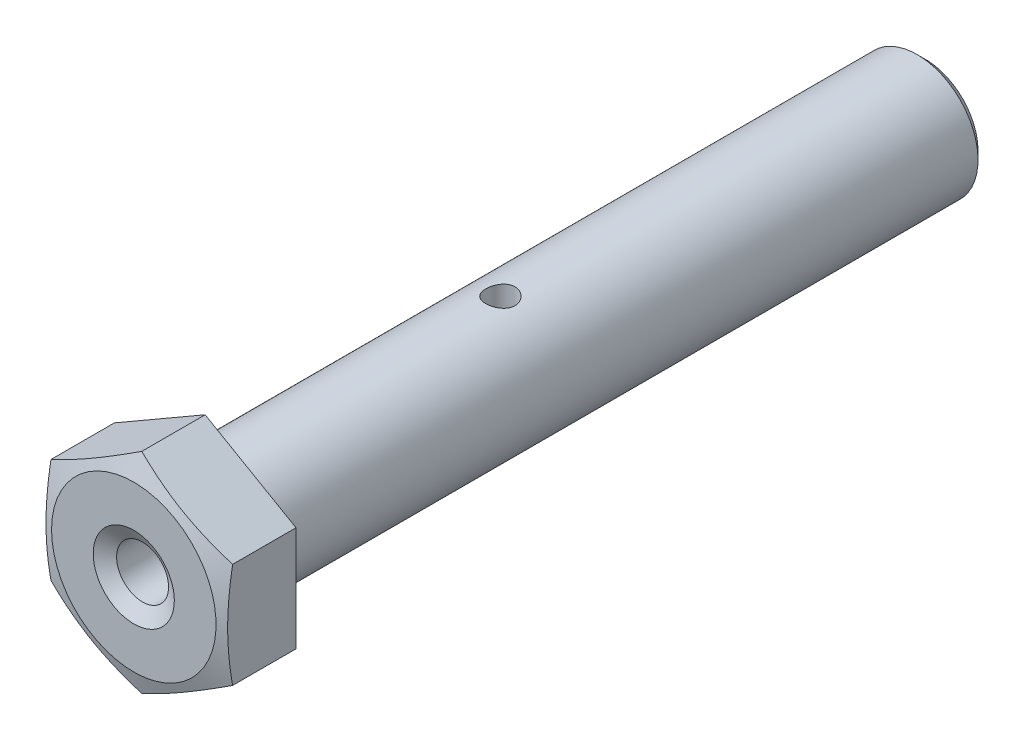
ISO-10303-21;
HEADER;
FILE_DESCRIPTION(('STEP AP214'),'2;1');
FILE_NAME('part.step','',(''),(''),'','','');
FILE_SCHEMA(('AUTOMOTIVE_DESIGN { 1 0 10303 214 1 1 1 1 }'));
ENDSEC;
DATA;
#1=APPLICATION_CONTEXT('core data for automotive mechanical design processes');
#2=APPLICATION_PROTOCOL_DEFINITION('international standard','automotive_design',2000,#1);
#3=PRODUCT_CONTEXT('',#1,'mechanical');
#4=PRODUCT('Part','Part','',(#3));
#5=PRODUCT_RELATED_PRODUCT_CATEGORY('part','',(#4));
#6=PRODUCT_DEFINITION_FORMATION('','',#4);
#7=PRODUCT_DEFINITION_CONTEXT('part definition',#1,'design');
#8=PRODUCT_DEFINITION('design','',#6,#7);
#9=PRODUCT_DEFINITION_SHAPE('','',#8);
#10=(LENGTH_UNIT() NAMED_UNIT(*) SI_UNIT(.MILLI.,.METRE.));
#11=(NAMED_UNIT(*) PLANE_ANGLE_UNIT() SI_UNIT($,.RADIAN.));
#12=(NAMED_UNIT(*) SI_UNIT($,.STERADIAN.) SOLID_ANGLE_UNIT());
#13=UNCERTAINTY_MEASURE_WITH_UNIT(LENGTH_MEASURE(1.E-05),#10,'distance_accuracy_value','');
#14=(GEOMETRIC_REPRESENTATION_CONTEXT(3) GLOBAL_UNCERTAINTY_ASSIGNED_CONTEXT((#13)) GLOBAL_UNIT_ASSIGNED_CONTEXT((#10,
#11,#12)) REPRESENTATION_CONTEXT('',''));
#15=CARTESIAN_POINT('',(0.,0.,0.));
#16=DIRECTION('',(0.,0.,1.));
#17=DIRECTION('',(1.,0.,0.));
#18=AXIS2_PLACEMENT_3D('',#15,#16,#17);
#19=CARTESIAN_POINT('',(0.,0.,4.95721434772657));
#20=DIRECTION('',(0.,0.,-1.));
#21=DIRECTION('',(-1.,0.,0.));
#22=AXIS2_PLACEMENT_3D('',#19,#20,#21);
#23=CONICAL_SURFACE('',#22,8.22286118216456,1.23066390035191);
#24=CARTESIAN_POINT('',(-7.11200000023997,4.1061151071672,4.960976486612));
#25=CARTESIAN_POINT('',(-6.81737936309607,4.27621441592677,5.02119241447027));
#26=CARTESIAN_POINT('',(-6.52183875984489,4.44684486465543,5.07595591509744));
#27=CARTESIAN_POINT('',(-5.92894062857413,4.78915476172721,5.17228765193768));
#28=CARTESIAN_POINT('',(-5.63158192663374,4.96083488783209,5.21384617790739));
#29=CARTESIAN_POINT('',(-5.03816993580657,5.30344146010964,5.28108026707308));
#30=CARTESIAN_POINT('',(-4.74212876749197,5.47436090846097,5.30689459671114));
#31=CARTESIAN_POINT('',(-4.14939155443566,5.81657789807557,5.3415176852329));
#32=CARTESIAN_POINT('',(-3.85269577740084,5.98787528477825,5.35033243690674));
#33=CARTESIAN_POINT('',(-3.25930422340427,6.3304700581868,5.35033243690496));
#34=CARTESIAN_POINT('',(-2.96260844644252,6.50176744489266,5.3415176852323));
#35=CARTESIAN_POINT('',(-2.36987123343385,6.84398443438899,5.30689459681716));
#36=CARTESIAN_POINT('',(-2.0738300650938,7.01490388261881,5.2810802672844));
#37=CARTESIAN_POINT('',(-1.48041807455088,7.35751045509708,5.21384617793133));
#38=CARTESIAN_POINT('',(-1.18305937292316,7.52919058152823,5.17228765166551));
#39=CARTESIAN_POINT('',(-0.590161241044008,7.87150047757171,5.075955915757));
#40=CARTESIAN_POINT('',(-0.294620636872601,8.04213092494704,5.02119241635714));
#41=CARTESIAN_POINT('',(2.60407290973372E-09,8.2122302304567,4.96097649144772));
#42=B_SPLINE_CURVE_WITH_KNOTS('',3,(#24,#25,#26,#27,#28,#29,#30,#31,#32,#33,#34,#35,#36,#37,#38,
#39,#40,#41),.UNSPECIFIED.,.F.,.F.,(4,2,2,2,2,2,2,2,4),(0.,1.03656037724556,2.07388123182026,
3.1019219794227,4.12960024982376,5.15727852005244,6.18531926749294,7.22264012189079,
8.25920049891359),.UNSPECIFIED.);
#43=CARTESIAN_POINT('',(-7.11200000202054,4.10611511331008,4.96097649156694));
#44=VERTEX_POINT('',#43);
#45=CARTESIAN_POINT('',(0.,8.21223023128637,4.96097649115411));
#46=VERTEX_POINT('',#45);
#47=EDGE_CURVE('E20',#44,#46,#42,.T.);
#48=ORIENTED_EDGE('',*,*,#47,.F.);
#49=CARTESIAN_POINT('',(-7.11199999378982,4.10611511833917,4.960976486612));
#50=CARTESIAN_POINT('',(-7.11199999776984,3.76591650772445,5.02119241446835));
#51=CARTESIAN_POINT('',(-7.11199999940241,3.42465561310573,5.07595591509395));
#52=CARTESIAN_POINT('',(-7.11200000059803,2.74003582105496,5.17228765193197));
#53=CARTESIAN_POINT('',(-7.11200000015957,2.39667556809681,5.21384617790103));
#54=CARTESIAN_POINT('',(-7.11199999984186,1.71146242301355,5.28108026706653));
#55=CARTESIAN_POINT('',(-7.11199999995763,1.36962352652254,5.30689459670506));
#56=CARTESIAN_POINT('',(-7.11200000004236,0.685189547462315,5.34151768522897));
#57=CARTESIAN_POINT('',(-7.11200000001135,0.342594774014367,5.3503324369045));
#58=CARTESIAN_POINT('',(-7.11199999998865,-0.342594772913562,5.35033243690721));
#59=CARTESIAN_POINT('',(-7.11199999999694,-0.685189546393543,5.34151768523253));
#60=CARTESIAN_POINT('',(-7.11200000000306,-1.36962352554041,5.30689459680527));
#61=CARTESIAN_POINT('',(-7.11200000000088,-1.71146242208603,5.28108026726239));
#62=CARTESIAN_POINT('',(-7.11199999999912,-2.39667556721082,5.21384617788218));
#63=CARTESIAN_POINT('',(-7.11199999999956,-2.74003582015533,5.17228765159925));
#64=CARTESIAN_POINT('',(-7.11200000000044,-3.42465561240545,5.07595591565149));
#65=CARTESIAN_POINT('',(-7.11200000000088,-3.76591650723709,5.0211924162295));
#66=CARTESIAN_POINT('',(-7.112,-4.10611511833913,4.96097649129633));
#67=B_SPLINE_CURVE_WITH_KNOTS('',3,(#49,#50,#51,#52,#53,#54,#55,#56,#57,#58,#59,#60,#61,#62,#63,
#64,#65,#66),.UNSPECIFIED.,.F.,.F.,(4,2,2,2,2,2,2,2,4),(0.,1.03656037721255,2.07388123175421,
3.10192197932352,4.12960024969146,5.1572785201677,6.18531926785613,7.22264012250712,
8.25920049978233),.UNSPECIFIED.);
#68=CARTESIAN_POINT('',(-7.11200000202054,-4.10611511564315,4.96097649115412));
#69=VERTEX_POINT('',#68);
#70=EDGE_CURVE('E73',#44,#69,#67,.T.);
#71=ORIENTED_EDGE('',*,*,#70,.T.);
#72=CARTESIAN_POINT('',(6.45011977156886E-09,-8.21223022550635,4.960976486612));
#73=CARTESIAN_POINT('',(-0.294620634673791,-8.04213092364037,5.02119241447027));
#74=CARTESIAN_POINT('',(-0.590161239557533,-7.8715004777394,5.07595591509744));
#75=CARTESIAN_POINT('',(-1.18305937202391,-7.52919058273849,5.17228765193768));
#76=CARTESIAN_POINT('',(-1.48041807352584,-7.35751045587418,5.21384617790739));
#77=CARTESIAN_POINT('',(-2.07383006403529,-7.01490388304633,5.28108026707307));
#78=CARTESIAN_POINT('',(-2.36987123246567,-6.84398443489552,5.30689459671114));
#79=CARTESIAN_POINT('',(-2.9626084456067,-6.50176744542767,5.3415176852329));
#80=CARTESIAN_POINT('',(-3.25930422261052,-6.33047005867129,5.35033243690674));
#81=CARTESIAN_POINT('',(-3.85269577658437,-5.98787528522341,5.35033243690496));
#82=CARTESIAN_POINT('',(-4.14939155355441,-5.81657789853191,5.3415176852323));
#83=CARTESIAN_POINT('',(-4.74212876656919,-5.47436090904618,5.30689459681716));
#84=CARTESIAN_POINT('',(-5.03816993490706,-5.30344146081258,5.28108026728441));
#85=CARTESIAN_POINT('',(-5.63158192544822,-4.96083488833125,5.21384617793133));
#86=CARTESIAN_POINT('',(-5.92894062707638,-4.78915476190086,5.17228765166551));
#87=CARTESIAN_POINT('',(-6.52183875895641,-4.44684486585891,5.07595591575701));
#88=CARTESIAN_POINT('',(-6.81737936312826,-4.27621441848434,5.02119241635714));
#89=CARTESIAN_POINT('',(-7.11200000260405,-4.10611511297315,4.96097649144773));
#90=B_SPLINE_CURVE_WITH_KNOTS('',3,(#72,#73,#74,#75,#76,#77,#78,#79,#80,#81,#82,#83,#84,#85,#86,
#87,#88,#89),.UNSPECIFIED.,.F.,.F.,(4,2,2,2,2,2,2,2,4),(0.,1.03656037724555,2.07388123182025,
3.10192197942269,4.12960024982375,5.15727852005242,6.18531926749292,7.22264012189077,
8.25920049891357),.UNSPECIFIED.);
#91=CARTESIAN_POINT('',(0.,-8.21223023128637,4.96097649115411));
#92=VERTEX_POINT('',#91);
#93=EDGE_CURVE('E102',#92,#69,#90,.T.);
#94=ORIENTED_EDGE('',*,*,#93,.F.);
#95=CARTESIAN_POINT('',(7.11200000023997,-4.1061151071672,4.96097648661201));
#96=CARTESIAN_POINT('',(6.81737936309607,-4.27621441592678,5.02119241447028));
#97=CARTESIAN_POINT('',(6.52183875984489,-4.44684486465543,5.07595591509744));
#98=CARTESIAN_POINT('',(5.92894062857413,-4.78915476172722,5.17228765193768));
#99=CARTESIAN_POINT('',(5.63158192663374,-4.96083488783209,5.21384617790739));
#100=CARTESIAN_POINT('',(5.03816993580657,-5.30344146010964,5.28108026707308));
#101=CARTESIAN_POINT('',(4.74212876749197,-5.47436090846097,5.30689459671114));
#102=CARTESIAN_POINT('',(4.14939155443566,-5.81657789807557,5.3415176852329));
#103=CARTESIAN_POINT('',(3.85269577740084,-5.98787528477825,5.35033243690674));
#104=CARTESIAN_POINT('',(3.25930422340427,-6.3304700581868,5.35033243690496));
#105=CARTESIAN_POINT('',(2.96260844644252,-6.50176744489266,5.3415176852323));
#106=CARTESIAN_POINT('',(2.36987123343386,-6.84398443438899,5.30689459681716));
#107=CARTESIAN_POINT('',(2.0738300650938,-7.01490388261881,5.28108026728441));
#108=CARTESIAN_POINT('',(1.48041807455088,-7.35751045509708,5.21384617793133));
#109=CARTESIAN_POINT('',(1.18305937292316,-7.52919058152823,5.17228765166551));
#110=CARTESIAN_POINT('',(0.590161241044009,-7.8715004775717,5.075955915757));
#111=CARTESIAN_POINT('',(0.294620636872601,-8.04213092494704,5.02119241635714));
#112=CARTESIAN_POINT('',(-2.6040717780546E-09,-8.2122302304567,4.96097649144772));
#113=B_SPLINE_CURVE_WITH_KNOTS('',3,(#95,#96,#97,#98,#99,#100,#101,#102,#103,#104,#105,#106,
#107,#108,#109,#110,#111,#112),.UNSPECIFIED.,.F.,.F.,(4,2,2,2,2,2,2,2,4),(0.,1.03656037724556,
2.07388123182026,3.1019219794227,4.12960024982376,5.15727852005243,6.18531926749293,
7.22264012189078,8.25920049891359),.UNSPECIFIED.);
#114=CARTESIAN_POINT('',(7.11200000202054,-4.1061151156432,4.96097649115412));
#115=VERTEX_POINT('',#114);
#116=EDGE_CURVE('E126',#115,#92,#113,.T.);
#117=ORIENTED_EDGE('',*,*,#116,.F.);
#118=CARTESIAN_POINT('',(7.11199999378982,4.10611511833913,4.96097648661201));
#119=CARTESIAN_POINT('',(7.11199999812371,3.76591650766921,5.02119241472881));
#120=CARTESIAN_POINT('',(7.1119999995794,3.42465561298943,5.07595591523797));
#121=CARTESIAN_POINT('',(7.11200000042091,2.74003582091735,5.17228765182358));
#122=CARTESIAN_POINT('',(7.11199999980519,2.39667556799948,5.2138461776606));
#123=CARTESIAN_POINT('',(7.11200000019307,1.71146242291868,5.28108026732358));
#124=CARTESIAN_POINT('',(7.11200000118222,1.36962352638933,5.30689459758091));
#125=CARTESIAN_POINT('',(7.1119999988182,0.685189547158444,5.34151768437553));
#126=CARTESIAN_POINT('',(7.11199999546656,0.342594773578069,5.35033243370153));
#127=CARTESIAN_POINT('',(7.11199999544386,-0.342594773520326,5.35033243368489));
#128=CARTESIAN_POINT('',(7.11199999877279,-0.685189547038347,5.34151768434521));
#129=CARTESIAN_POINT('',(7.11200000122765,-1.36962352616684,5.30689459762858));
#130=CARTESIAN_POINT('',(7.11200000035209,-1.71146242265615,5.28108026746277));
#131=CARTESIAN_POINT('',(7.11199999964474,-2.39667556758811,5.21384617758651));
#132=CARTESIAN_POINT('',(7.11199999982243,-2.74003582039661,5.17228765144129));
#133=CARTESIAN_POINT('',(7.11200000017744,-3.42465561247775,5.07595591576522));
#134=CARTESIAN_POINT('',(7.11200000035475,-3.76591650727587,5.02119241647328));
#135=CARTESIAN_POINT('',(7.112,-4.10611511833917,4.96097649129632));
#136=B_SPLINE_CURVE_WITH_KNOTS('',3,(#118,#119,#120,#121,#122,#123,#124,#125,#126,#127,#128,
#129,#130,#131,#132,#133,#134,#135),.UNSPECIFIED.,.F.,.F.,(4,2,2,2,2,2,2,2,4),(0.,
1.03656037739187,2.07388123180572,3.10192197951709,4.12960025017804,5.15727852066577,
6.18531926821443,7.22264012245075,8.25920049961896),.UNSPECIFIED.);
#137=CARTESIAN_POINT('',(7.11200000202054,4.10611511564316,4.96097649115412));
#138=VERTEX_POINT('',#137);
#139=EDGE_CURVE('E133',#138,#115,#136,.T.);
#140=ORIENTED_EDGE('',*,*,#139,.F.);
#141=CARTESIAN_POINT('',(-6.45011611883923E-09,8.21223022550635,4.960976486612));
#142=CARTESIAN_POINT('',(0.294620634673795,8.04213092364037,5.02119241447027));
#143=CARTESIAN_POINT('',(0.590161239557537,7.8715004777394,5.07595591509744));
#144=CARTESIAN_POINT('',(1.18305937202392,7.52919058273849,5.17228765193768));
#145=CARTESIAN_POINT('',(1.48041807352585,7.35751045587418,5.21384617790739));
#146=CARTESIAN_POINT('',(2.0738300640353,7.01490388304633,5.28108026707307));
#147=CARTESIAN_POINT('',(2.36987123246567,6.84398443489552,5.30689459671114));
#148=CARTESIAN_POINT('',(2.96260844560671,6.50176744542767,5.3415176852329));
#149=CARTESIAN_POINT('',(3.25930422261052,6.33047005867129,5.35033243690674));
#150=CARTESIAN_POINT('',(3.85269577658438,5.98787528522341,5.35033243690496));
#151=CARTESIAN_POINT('',(4.14939155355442,5.81657789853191,5.3415176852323));
#152=CARTESIAN_POINT('',(4.7421287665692,5.47436090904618,5.30689459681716));
#153=CARTESIAN_POINT('',(5.03816993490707,5.30344146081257,5.28108026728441));
#154=CARTESIAN_POINT('',(5.63158192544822,4.96083488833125,5.21384617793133));
#155=CARTESIAN_POINT('',(5.92894062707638,4.78915476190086,5.17228765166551));
#156=CARTESIAN_POINT('',(6.52183875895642,4.44684486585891,5.075955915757));
#157=CARTESIAN_POINT('',(6.81737936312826,4.27621441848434,5.02119241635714));
#158=CARTESIAN_POINT('',(7.11200000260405,4.10611511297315,4.96097649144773));
#159=B_SPLINE_CURVE_WITH_KNOTS('',3,(#141,#142,#143,#144,#145,#146,#147,#148,#149,#150,#151,
#152,#153,#154,#155,#156,#157,#158),.UNSPECIFIED.,.F.,.F.,(4,2,2,2,2,2,2,2,4),(0.,
1.03656037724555,2.07388123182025,3.10192197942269,4.12960024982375,5.15727852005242,
6.18531926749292,7.22264012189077,8.25920049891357),.UNSPECIFIED.);
#160=EDGE_CURVE('E76',#46,#138,#159,.T.);
#161=ORIENTED_EDGE('',*,*,#160,.F.);
#162=EDGE_LOOP('',(#48,#71,#94,#117,#140,#161));
#163=FACE_BOUND('',#162,.T.);
#164=CARTESIAN_POINT('',(0.,0.,5.58800002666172));
#165=DIRECTION('',(0.,0.,-1.));
#166=DIRECTION('',(-1.,0.,0.));
#167=AXIS2_PLACEMENT_3D('',#164,#165,#166);
#168=CIRCLE('',#167,6.44040612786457);
#169=CARTESIAN_POINT('',(-6.44040612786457,0.,5.58800002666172));
#170=VERTEX_POINT('',#169);
#171=EDGE_CURVE('E92',#170,#170,#168,.T.);
#172=ORIENTED_EDGE('',*,*,#171,.T.);
#173=EDGE_LOOP('',(#172));
#174=FACE_BOUND('',#173,.T.);
#175=ADVANCED_FACE('F16',(#163,#174),#23,.T.);
#176=CARTESIAN_POINT('',(-7.112,4.10611511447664,5.588));
#177=DIRECTION('',(-0.499999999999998,0.86602540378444,0.));
#178=DIRECTION('',(-0.86602540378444,-0.499999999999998,0.));
#179=AXIS2_PLACEMENT_3D('',#176,#177,#178);
#180=PLANE('',#179);
#181=DIRECTION('',(0.,0.,1.));
#182=VECTOR('',#181,1.);
#183=CARTESIAN_POINT('',(0.,8.21223022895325,5.588));
#184=LINE('',#183,#182);
#185=CARTESIAN_POINT('',(0.,8.21223022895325,0.));
#186=VERTEX_POINT('',#185);
#187=EDGE_CURVE('E79',#186,#46,#184,.T.);
#188=ORIENTED_EDGE('',*,*,#187,.F.);
#189=DIRECTION('',(0.86602540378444,0.499999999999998,0.));
#190=VECTOR('',#189,1.);
#191=CARTESIAN_POINT('',(-7.112,4.10611511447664,0.));
#192=LINE('',#191,#190);
#193=CARTESIAN_POINT('',(-7.112,4.10611511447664,0.));
#194=VERTEX_POINT('',#193);
#195=EDGE_CURVE('E84',#194,#186,#192,.T.);
#196=ORIENTED_EDGE('',*,*,#195,.F.);
#197=DIRECTION('',(0.,0.,-1.));
#198=VECTOR('',#197,1.);
#199=CARTESIAN_POINT('',(-7.112,4.10611511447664,5.588));
#200=LINE('',#199,#198);
#201=EDGE_CURVE('E81',#194,#44,#200,.F.);
#202=ORIENTED_EDGE('',*,*,#201,.T.);
#203=ORIENTED_EDGE('',*,*,#47,.T.);
#204=EDGE_LOOP('',(#188,#196,#202,#203));
#205=FACE_BOUND('',#204,.T.);
#206=ADVANCED_FACE('F82',(#205),#180,.T.);
#207=CARTESIAN_POINT('',(0.,8.21223022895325,5.588));
#208=DIRECTION('',(0.500000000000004,0.866025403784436,0.));
#209=DIRECTION('',(-0.866025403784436,0.500000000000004,0.));
#210=AXIS2_PLACEMENT_3D('',#207,#208,#209);
#211=PLANE('',#210);
#212=DIRECTION('',(0.,0.,-1.));
#213=VECTOR('',#212,1.);
#214=CARTESIAN_POINT('',(7.112,4.10611511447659,5.588));
#215=LINE('',#214,#213);
#216=CARTESIAN_POINT('',(7.112,4.10611511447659,0.));
#217=VERTEX_POINT('',#216);
#218=EDGE_CURVE('E137',#217,#138,#215,.F.);
#219=ORIENTED_EDGE('',*,*,#218,.F.);
#220=DIRECTION('',(0.866025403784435,-0.500000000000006,0.));
#221=VECTOR('',#220,1.);
#222=CARTESIAN_POINT('',(0.,8.21223022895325,0.));
#223=LINE('',#222,#221);
#224=EDGE_CURVE('E237',#186,#217,#223,.T.);
#225=ORIENTED_EDGE('',*,*,#224,.F.);
#226=ORIENTED_EDGE('',*,*,#187,.T.);
#227=ORIENTED_EDGE('',*,*,#160,.T.);
#228=EDGE_LOOP('',(#219,#225,#226,#227));
#229=FACE_BOUND('',#228,.T.);
#230=ADVANCED_FACE('F141',(#229),#211,.T.);
#231=CARTESIAN_POINT('',(7.112,4.10611511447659,5.588));
#232=DIRECTION('',(1.,0.,0.));
#233=DIRECTION('',(0.,0.,-1.));
#234=AXIS2_PLACEMENT_3D('',#231,#232,#233);
#235=PLANE('',#234);
#236=DIRECTION('',(0.,0.,1.));
#237=VECTOR('',#236,1.);
#238=CARTESIAN_POINT('',(7.112,-4.10611511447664,5.588));
#239=LINE('',#238,#237);
#240=CARTESIAN_POINT('',(7.112,-4.10611511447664,0.));
#241=VERTEX_POINT('',#240);
#242=EDGE_CURVE('E132',#241,#115,#239,.T.);
#243=ORIENTED_EDGE('',*,*,#242,.F.);
#244=DIRECTION('',(0.,1.,0.));
#245=VECTOR('',#244,1.);
#246=CARTESIAN_POINT('',(7.112,12.3183453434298,0.));
#247=LINE('',#246,#245);
#248=EDGE_CURVE('E227',#217,#241,#247,.F.);
#249=ORIENTED_EDGE('',*,*,#248,.F.);
#250=ORIENTED_EDGE('',*,*,#218,.T.);
#251=ORIENTED_EDGE('',*,*,#139,.T.);
#252=EDGE_LOOP('',(#243,#249,#250,#251));
#253=FACE_BOUND('',#252,.T.);
#254=ADVANCED_FACE('F122',(#253),#235,.T.);
#255=CARTESIAN_POINT('',(7.112,-4.10611511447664,5.588));
#256=DIRECTION('',(0.499999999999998,-0.86602540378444,0.));
#257=DIRECTION('',(0.86602540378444,0.499999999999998,0.));
#258=AXIS2_PLACEMENT_3D('',#255,#256,#257);
#259=PLANE('',#258);
#260=DIRECTION('',(0.,0.,1.));
#261=VECTOR('',#260,1.);
#262=CARTESIAN_POINT('',(0.,-8.21223022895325,5.588));
#263=LINE('',#262,#261);
#264=CARTESIAN_POINT('',(0.,-8.21223022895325,0.));
#265=VERTEX_POINT('',#264);
#266=EDGE_CURVE('E131',#265,#92,#263,.T.);
#267=ORIENTED_EDGE('',*,*,#266,.F.);
#268=DIRECTION('',(-0.86602540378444,-0.499999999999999,0.));
#269=VECTOR('',#268,1.);
#270=CARTESIAN_POINT('',(7.112,-4.10611511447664,0.));
#271=LINE('',#270,#269);
#272=EDGE_CURVE('E222',#241,#265,#271,.T.);
#273=ORIENTED_EDGE('',*,*,#272,.F.);
#274=ORIENTED_EDGE('',*,*,#242,.T.);
#275=ORIENTED_EDGE('',*,*,#116,.T.);
#276=EDGE_LOOP('',(#267,#273,#274,#275));
#277=FACE_BOUND('',#276,.T.);
#278=ADVANCED_FACE('F117',(#277),#259,.T.);
#279=CARTESIAN_POINT('',(0.,-8.21223022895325,5.588));
#280=DIRECTION('',(-0.500000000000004,-0.866025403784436,0.));
#281=DIRECTION('',(0.866025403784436,-0.500000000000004,0.));
#282=AXIS2_PLACEMENT_3D('',#279,#280,#281);
#283=PLANE('',#282);
#284=DIRECTION('',(0.,0.,-1.));
#285=VECTOR('',#284,1.);
#286=CARTESIAN_POINT('',(-7.112,-4.10611511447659,5.588));
#287=LINE('',#286,#285);
#288=CARTESIAN_POINT('',(-7.112,-4.10611511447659,0.));
#289=VERTEX_POINT('',#288);
#290=EDGE_CURVE('E88',#69,#289,#287,.T.);
#291=ORIENTED_EDGE('',*,*,#290,.T.);
#292=DIRECTION('',(-0.866025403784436,0.500000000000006,0.));
#293=VECTOR('',#292,1.);
#294=CARTESIAN_POINT('',(0.,-8.21223022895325,0.));
#295=LINE('',#294,#293);
#296=EDGE_CURVE('E218',#265,#289,#295,.T.);
#297=ORIENTED_EDGE('',*,*,#296,.F.);
#298=ORIENTED_EDGE('',*,*,#266,.T.);
#299=ORIENTED_EDGE('',*,*,#93,.T.);
#300=EDGE_LOOP('',(#291,#297,#298,#299));
#301=FACE_BOUND('',#300,.T.);
#302=ADVANCED_FACE('F112',(#301),#283,.T.);
#303=CARTESIAN_POINT('',(-7.112,4.10611511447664,5.588));
#304=DIRECTION('',(1.,0.,0.));
#305=DIRECTION('',(0.,0.,-1.));
#306=AXIS2_PLACEMENT_3D('',#303,#304,#305);
#307=PLANE('',#306);
#308=ORIENTED_EDGE('',*,*,#201,.F.);
#309=DIRECTION('',(0.,1.,0.));
#310=VECTOR('',#309,1.);
#311=CARTESIAN_POINT('',(-7.112,12.3183453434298,0.));
#312=LINE('',#311,#310);
#313=EDGE_CURVE('E219',#289,#194,#312,.T.);
#314=ORIENTED_EDGE('',*,*,#313,.F.);
#315=ORIENTED_EDGE('',*,*,#290,.F.);
#316=ORIENTED_EDGE('',*,*,#70,.F.);
#317=EDGE_LOOP('',(#308,#314,#315,#316));
#318=FACE_BOUND('',#317,.T.);
#319=ADVANCED_FACE('F91',(#318),#307,.F.);
#320=CARTESIAN_POINT('',(7.112,12.3183453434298,5.588));
#321=DIRECTION('',(0.,0.,-1.));
#322=DIRECTION('',(-1.,0.,0.));
#323=AXIS2_PLACEMENT_3D('',#320,#321,#322);
#324=PLANE('',#323);
#325=CARTESIAN_POINT('',(0.,0.,5.58799997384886));
#326=DIRECTION('',(0.,0.,1.));
#327=DIRECTION('',(1.,0.,0.));
#328=AXIS2_PLACEMENT_3D('',#325,#326,#327);
#329=CIRCLE('',#328,3.1750000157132);
#330=CARTESIAN_POINT('',(3.1750000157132,0.,5.58799997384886));
#331=VERTEX_POINT('',#330);
#332=EDGE_CURVE('E225',#331,#331,#329,.F.);
#333=ORIENTED_EDGE('',*,*,#332,.T.);
#334=EDGE_LOOP('',(#333));
#335=FACE_BOUND('',#334,.T.);
#336=ORIENTED_EDGE('',*,*,#171,.F.);
#337=EDGE_LOOP('',(#336));
#338=FACE_BOUND('',#337,.T.);
#339=ADVANCED_FACE('F111',(#335,#338),#324,.F.);
#340=CARTESIAN_POINT('',(7.112,12.3183453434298,0.));
#341=DIRECTION('',(0.,0.,-1.));
#342=DIRECTION('',(-1.,0.,0.));
#343=AXIS2_PLACEMENT_3D('',#340,#341,#342);
#344=PLANE('',#343);
#345=CARTESIAN_POINT('',(0.,0.,0.));
#346=DIRECTION('',(0.,0.,-1.));
#347=DIRECTION('',(-1.,0.,0.));
#348=AXIS2_PLACEMENT_3D('',#345,#346,#347);
#349=CIRCLE('',#348,6.096);
#350=CARTESIAN_POINT('',(-6.096,0.,0.));
#351=VERTEX_POINT('',#350);
#352=EDGE_CURVE('E214',#351,#351,#349,.T.);
#353=ORIENTED_EDGE('',*,*,#352,.F.);
#354=EDGE_LOOP('',(#353));
#355=FACE_BOUND('',#354,.T.);
#356=ORIENTED_EDGE('',*,*,#296,.T.);
#357=ORIENTED_EDGE('',*,*,#313,.T.);
#358=ORIENTED_EDGE('',*,*,#195,.T.);
#359=ORIENTED_EDGE('',*,*,#224,.T.);
#360=ORIENTED_EDGE('',*,*,#248,.T.);
#361=ORIENTED_EDGE('',*,*,#272,.T.);
#362=EDGE_LOOP('',(#356,#357,#358,#359,#360,#361));
#363=FACE_BOUND('',#362,.T.);
#364=ADVANCED_FACE('F203',(#355,#363),#344,.T.);
#365=CARTESIAN_POINT('',(0.,0.,5.58799997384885));
#366=DIRECTION('',(0.,0.,1.));
#367=DIRECTION('',(1.,0.,0.));
#368=AXIS2_PLACEMENT_3D('',#365,#366,#367);
#369=CONICAL_SURFACE('',#368,3.17500001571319,1.0297442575);
#370=ORIENTED_EDGE('',*,*,#332,.F.);
#371=EDGE_LOOP('',(#370));
#372=FACE_BOUND('',#371,.T.);
#373=CARTESIAN_POINT('',(0.,0.,4.9012163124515));
#374=DIRECTION('',(0.,0.,-1.));
#375=DIRECTION('',(-1.,0.,0.));
#376=AXIS2_PLACEMENT_3D('',#373,#374,#375);
#377=CIRCLE('',#376,2.032);
#378=CARTESIAN_POINT('',(-2.032,0.,4.9012163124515));
#379=VERTEX_POINT('',#378);
#380=EDGE_CURVE('E266',#379,#379,#377,.T.);
#381=ORIENTED_EDGE('',*,*,#380,.T.);
#382=EDGE_LOOP('',(#381));
#383=FACE_BOUND('',#382,.T.);
#384=ADVANCED_FACE('F201',(#372,#383),#369,.F.);
#385=CARTESIAN_POINT('',(0.,0.,-25.0417126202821));
#386=DIRECTION('',(0.,0.,1.));
#387=DIRECTION('',(1.,0.,0.));
#388=AXIS2_PLACEMENT_3D('',#385,#386,#387);
#389=CONICAL_SURFACE('',#388,2.03200159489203,1.39626339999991);
#390=CARTESIAN_POINT('',(1.77635683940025E-12,0.,-25.4000093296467));
#391=VERTEX_POINT('',#390);
#392=VERTEX_LOOP('',#391);
#393=FACE_BOUND('',#392,.T.);
#394=CARTESIAN_POINT('',(0.,0.,-25.0417129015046));
#395=DIRECTION('',(0.,0.,1.));
#396=DIRECTION('',(1.,0.,0.));
#397=AXIS2_PLACEMENT_3D('',#394,#395,#396);
#398=CIRCLE('',#397,2.032);
#399=CARTESIAN_POINT('',(2.032,0.,-25.0417129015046));
#400=VERTEX_POINT('',#399);
#401=EDGE_CURVE('E269',#400,#400,#398,.T.);
#402=ORIENTED_EDGE('',*,*,#401,.T.);
#403=EDGE_LOOP('',(#402));
#404=FACE_BOUND('',#403,.T.);
#405=ADVANCED_FACE('F197',(#393,#404),#389,.F.);
#406=CARTESIAN_POINT('',(0.,0.,0.));
#407=DIRECTION('',(0.,0.,-1.));
#408=DIRECTION('',(-1.,0.,0.));
#409=AXIS2_PLACEMENT_3D('',#406,#407,#408);
#410=CYLINDRICAL_SURFACE('',#409,6.096);
#411=CARTESIAN_POINT('',(0.,0.,-0.508));
#412=DIRECTION('',(0.,0.,-1.));
#413=DIRECTION('',(-1.,0.,0.));
#414=AXIS2_PLACEMENT_3D('',#411,#412,#413);
#415=CIRCLE('',#414,6.096);
#416=CARTESIAN_POINT('',(-6.096,0.,-0.508));
#417=VERTEX_POINT('',#416);
#418=EDGE_CURVE('E280',#417,#417,#415,.F.);
#419=ORIENTED_EDGE('',*,*,#418,.T.);
#420=EDGE_LOOP('',(#419));
#421=FACE_BOUND('',#420,.T.);
#422=ORIENTED_EDGE('',*,*,#352,.T.);
#423=EDGE_LOOP('',(#422));
#424=FACE_BOUND('',#423,.T.);
#425=ADVANCED_FACE('F193',(#421,#424),#410,.T.);
#426=CARTESIAN_POINT('',(0.,0.,-56.388));
#427=DIRECTION('',(0.,0.,-1.));
#428=DIRECTION('',(-1.,0.,0.));
#429=AXIS2_PLACEMENT_3D('',#426,#427,#428);
#430=PLANE('',#429);
#431=CARTESIAN_POINT('',(0.,0.,-56.388000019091));
#432=DIRECTION('',(0.,0.,1.));
#433=DIRECTION('',(0.,-1.,0.));
#434=AXIS2_PLACEMENT_3D('',#431,#432,#433);
#435=CIRCLE('',#434,4.12750001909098);
#436=CARTESIAN_POINT('',(0.,-4.12750001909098,-56.388000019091));
#437=VERTEX_POINT('',#436);
#438=EDGE_CURVE('E181',#437,#437,#435,.T.);
#439=ORIENTED_EDGE('',*,*,#438,.F.);
#440=EDGE_LOOP('',(#439));
#441=FACE_BOUND('',#440,.T.);
#442=ADVANCED_FACE('F189',(#441),#430,.T.);
#443=CARTESIAN_POINT('',(0.,0.,0.));
#444=DIRECTION('',(0.,0.,-1.));
#445=DIRECTION('',(-1.,0.,0.));
#446=AXIS2_PLACEMENT_3D('',#443,#444,#445);
#447=CYLINDRICAL_SURFACE('',#446,2.032);
#448=ORIENTED_EDGE('',*,*,#401,.F.);
#449=EDGE_LOOP('',(#448));
#450=FACE_BOUND('',#449,.T.);
#451=CARTESIAN_POINT('',(0.,2.032,-24.257));
#452=CARTESIAN_POINT('',(-0.0592137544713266,2.03200153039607,-24.2570017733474));
#453=CARTESIAN_POINT('',(-0.118417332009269,2.02938970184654,-24.2523782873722));
#454=CARTESIAN_POINT('',(-0.234980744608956,2.01921571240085,-24.2341402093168));
#455=CARTESIAN_POINT('',(-0.292340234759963,2.0116526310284,-24.2205239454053));
#456=CARTESIAN_POINT('',(-0.403420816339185,1.99234694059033,-24.1850234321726));
#457=CARTESIAN_POINT('',(-0.457154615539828,1.98061994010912,-24.1631700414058));
#458=CARTESIAN_POINT('',(-0.560087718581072,1.95401016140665,-24.1120265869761));
#459=CARTESIAN_POINT('',(-0.609285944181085,1.93912663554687,-24.0827347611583));
#460=CARTESIAN_POINT('',(-0.705647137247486,1.90626789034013,-24.0152286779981));
#461=CARTESIAN_POINT('',(-0.752420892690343,1.88814854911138,-23.9765303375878));
#462=CARTESIAN_POINT('',(-0.839188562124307,1.85121976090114,-23.892376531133));
#463=CARTESIAN_POINT('',(-0.879175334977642,1.83240961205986,-23.8469140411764));
#464=CARTESIAN_POINT('',(-0.955458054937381,1.79391551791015,-23.7448881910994));
#465=CARTESIAN_POINT('',(-0.990931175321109,1.77434579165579,-23.6876611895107));
#466=CARTESIAN_POINT('',(-1.05159777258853,1.7390815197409,-23.5669212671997));
#467=CARTESIAN_POINT('',(-1.07680629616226,1.72338131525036,-23.5034177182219));
#468=CARTESIAN_POINT('',(-1.11149088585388,1.7011588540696,-23.3859207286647));
#469=CARTESIAN_POINT('',(-1.12318412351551,1.69338910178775,-23.3328179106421));
#470=CARTESIAN_POINT('',(-1.1388950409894,1.68286530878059,-23.2250212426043));
#471=CARTESIAN_POINT('',(-1.14292056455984,1.68010614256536,-23.1703290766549));
#472=CARTESIAN_POINT('',(-1.14307720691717,1.67999953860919,-23.0608638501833));
#473=CARTESIAN_POINT('',(-1.1391987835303,1.68265864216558,-23.0060907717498));
#474=CARTESIAN_POINT('',(-1.12375413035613,1.69301019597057,-22.8981189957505));
#475=CARTESIAN_POINT('',(-1.11218278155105,1.70070599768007,-22.8449213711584));
#476=CARTESIAN_POINT('',(-1.08193435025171,1.72010472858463,-22.7414821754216));
#477=CARTESIAN_POINT('',(-1.06326786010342,1.73180168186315,-22.6912363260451));
#478=CARTESIAN_POINT('',(-1.01947059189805,1.7579399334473,-22.5944279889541));
#479=CARTESIAN_POINT('',(-0.994337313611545,1.7723822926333,-22.5478669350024));
#480=CARTESIAN_POINT('',(-0.93379609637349,1.80510585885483,-22.4520595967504));
#481=CARTESIAN_POINT('',(-0.89739795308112,1.82363472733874,-22.4035226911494));
#482=CARTESIAN_POINT('',(-0.817423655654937,1.86085748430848,-22.312795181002));
#483=CARTESIAN_POINT('',(-0.773841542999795,1.8795514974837,-22.2706099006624));
#484=CARTESIAN_POINT('',(-0.675147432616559,1.91736235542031,-22.1892644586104));
#485=CARTESIAN_POINT('',(-0.619301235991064,1.93631126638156,-22.1509080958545));
#486=CARTESIAN_POINT('',(-0.500789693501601,1.97028473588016,-22.0843068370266));
#487=CARTESIAN_POINT('',(-0.438129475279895,1.98531221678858,-22.0560544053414));
#488=CARTESIAN_POINT('',(-0.313657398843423,2.00855165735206,-22.0130913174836));
#489=CARTESIAN_POINT('',(-0.252283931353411,2.01725810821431,-21.997384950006));
#490=CARTESIAN_POINT('',(-0.12726847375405,2.0289791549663,-21.9763444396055));
#491=CARTESIAN_POINT('',(-0.0636283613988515,2.03199835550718,-21.9710019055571));
#492=CARTESIAN_POINT('',(0.0592137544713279,2.03200153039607,-21.9709982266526));
#493=CARTESIAN_POINT('',(0.11841733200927,2.02938970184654,-21.9756217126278));
#494=CARTESIAN_POINT('',(0.234980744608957,2.01921571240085,-21.9938597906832));
#495=CARTESIAN_POINT('',(0.292340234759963,2.0116526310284,-22.0074760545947));
#496=CARTESIAN_POINT('',(0.403420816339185,1.99234694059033,-22.0429765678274));
#497=CARTESIAN_POINT('',(0.457154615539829,1.98061994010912,-22.0648299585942));
#498=CARTESIAN_POINT('',(0.560087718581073,1.95401016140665,-22.1159734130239));
#499=CARTESIAN_POINT('',(0.609285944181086,1.93912663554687,-22.1452652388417));
#500=CARTESIAN_POINT('',(0.705647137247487,1.90626789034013,-22.2127713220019));
#501=CARTESIAN_POINT('',(0.752420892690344,1.88814854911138,-22.2514696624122));
#502=CARTESIAN_POINT('',(0.839188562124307,1.85121976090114,-22.3356234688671));
#503=CARTESIAN_POINT('',(0.879175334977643,1.83240961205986,-22.3810859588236));
#504=CARTESIAN_POINT('',(0.955458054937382,1.79391551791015,-22.4831118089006));
#505=CARTESIAN_POINT('',(0.990931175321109,1.77434579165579,-22.5403388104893));
#506=CARTESIAN_POINT('',(1.05159777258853,1.7390815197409,-22.6610787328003));
#507=CARTESIAN_POINT('',(1.07680629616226,1.72338131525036,-22.7245822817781));
#508=CARTESIAN_POINT('',(1.11149088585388,1.7011588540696,-22.8420792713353));
#509=CARTESIAN_POINT('',(1.12318412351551,1.69338910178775,-22.8951820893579));
#510=CARTESIAN_POINT('',(1.1388950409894,1.68286530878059,-23.0029787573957));
#511=CARTESIAN_POINT('',(1.14292056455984,1.68010614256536,-23.0576709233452));
#512=CARTESIAN_POINT('',(1.14307720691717,1.67999953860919,-23.1671361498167));
#513=CARTESIAN_POINT('',(1.1391987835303,1.68265864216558,-23.2219092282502));
#514=CARTESIAN_POINT('',(1.12375413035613,1.69301019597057,-23.3298810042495));
#515=CARTESIAN_POINT('',(1.11218278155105,1.70070599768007,-23.3830786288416));
#516=CARTESIAN_POINT('',(1.08193435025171,1.72010472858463,-23.4865178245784));
#517=CARTESIAN_POINT('',(1.06326786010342,1.73180168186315,-23.5367636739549));
#518=CARTESIAN_POINT('',(1.01947059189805,1.7579399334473,-23.6335720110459));
#519=CARTESIAN_POINT('',(0.994337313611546,1.7723822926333,-23.6801330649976));
#520=CARTESIAN_POINT('',(0.933796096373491,1.80510585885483,-23.7759404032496));
#521=CARTESIAN_POINT('',(0.89739795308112,1.82363472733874,-23.8244773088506));
#522=CARTESIAN_POINT('',(0.817423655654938,1.86085748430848,-23.915204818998));
#523=CARTESIAN_POINT('',(0.773841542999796,1.8795514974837,-23.9573900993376));
#524=CARTESIAN_POINT('',(0.675147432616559,1.91736235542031,-24.0387355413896));
#525=CARTESIAN_POINT('',(0.619301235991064,1.93631126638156,-24.0770919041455));
#526=CARTESIAN_POINT('',(0.500789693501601,1.97028473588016,-24.1436931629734));
#527=CARTESIAN_POINT('',(0.438129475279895,1.98531221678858,-24.1719455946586));
#528=CARTESIAN_POINT('',(0.313657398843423,2.00855165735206,-24.2149086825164));
#529=CARTESIAN_POINT('',(0.252283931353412,2.01725810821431,-24.2306150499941));
#530=CARTESIAN_POINT('',(0.12726847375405,2.0289791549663,-24.2516555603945));
#531=CARTESIAN_POINT('',(0.0636283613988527,2.03199835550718,-24.2569980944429));
#532=CARTESIAN_POINT('',(0.,2.032,-24.257));
#533=B_SPLINE_CURVE_WITH_KNOTS('',3,(#451,#452,#453,#454,#455,#456,#457,#458,#459,#460,#461,
#462,#463,#464,#465,#466,#467,#468,#469,#470,#471,#472,#473,#474,#475,#476,#477,#478,#479,#480,
#481,#482,#483,#484,#485,#486,#487,#488,#489,#490,#491,#492,#493,#494,#495,#496,#497,#498,#499,
#500,#501,#502,#503,#504,#505,#506,#507,#508,#509,#510,#511,#512,#513,#514,#515,#516,#517,#518,
#519,#520,#521,#522,#523,#524,#525,#526,#527,#528,#529,#530,#531,#532),.UNSPECIFIED.,.T.,.F.,(4,
2,2,2,2,2,2,2,2,2,2,2,2,2,2,2,2,2,2,2,2,2,2,2,2,2,2,2,2,2,2,2,2,2,2,2,2,2,2,2,4),(0.,
0.177394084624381,0.354821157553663,0.53159004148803,0.708400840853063,0.89770040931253,
1.08719793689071,1.29650534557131,1.50550482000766,1.6695712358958,1.83346972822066,
1.99756620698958,2.16177198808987,2.32573358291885,2.48975866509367,2.6793045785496,
2.86900850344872,3.07896556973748,3.28876571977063,3.47953972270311,3.67015920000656,
3.84755328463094,4.02498035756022,4.20174924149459,4.37856004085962,4.56785960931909,
4.75735713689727,4.96666454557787,5.17566402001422,5.33973043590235,5.50362892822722,
5.66772540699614,5.83193118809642,5.9958927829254,6.15991786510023,6.34946377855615,
6.53916770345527,6.74912476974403,6.95892491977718,7.14969892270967,7.34031840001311),.UNSPECIFIED.);
#534=CARTESIAN_POINT('',(0.,2.032,-24.257));
#535=VERTEX_POINT('',#534);
#536=EDGE_CURVE('E175',#535,#535,#533,.T.);
#537=ORIENTED_EDGE('',*,*,#536,.T.);
#538=EDGE_LOOP('',(#537));
#539=FACE_BOUND('',#538,.T.);
#540=ORIENTED_EDGE('',*,*,#380,.F.);
#541=EDGE_LOOP('',(#540));
#542=FACE_BOUND('',#541,.T.);
#543=ADVANCED_FACE('F183',(#450,#539,#542),#447,.F.);
#544=CARTESIAN_POINT('',(0.,6.096,-0.508));
#545=DIRECTION('',(0.,0.,1.));
#546=DIRECTION('',(1.,0.,0.));
#547=AXIS2_PLACEMENT_3D('',#544,#545,#546);
#548=PLANE('',#547);
#549=CARTESIAN_POINT('',(0.,0.,-0.508));
#550=DIRECTION('',(0.,0.,-1.));
#551=DIRECTION('',(-1.,0.,0.));
#552=AXIS2_PLACEMENT_3D('',#549,#550,#551);
#553=CIRCLE('',#552,4.7625);
#554=CARTESIAN_POINT('',(-4.7625,0.,-0.508));
#555=VERTEX_POINT('',#554);
#556=EDGE_CURVE('E172',#555,#555,#553,.T.);
#557=ORIENTED_EDGE('',*,*,#556,.F.);
#558=EDGE_LOOP('',(#557));
#559=FACE_BOUND('',#558,.T.);
#560=ORIENTED_EDGE('',*,*,#418,.F.);
#561=EDGE_LOOP('',(#560));
#562=FACE_BOUND('',#561,.T.);
#563=ADVANCED_FACE('F188',(#559,#562),#548,.F.);
#564=CARTESIAN_POINT('',(0.,0.,-55.7530000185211));
#565=DIRECTION('',(0.,0.,1.));
#566=DIRECTION('',(0.,-1.,0.));
#567=AXIS2_PLACEMENT_3D('',#564,#565,#566);
#568=CONICAL_SURFACE('',#567,4.76250001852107,0.785398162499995);
#569=CARTESIAN_POINT('',(0.,0.,-55.753));
#570=DIRECTION('',(0.,0.,-1.));
#571=DIRECTION('',(-1.,0.,0.));
#572=AXIS2_PLACEMENT_3D('',#569,#570,#571);
#573=CIRCLE('',#572,4.7625);
#574=CARTESIAN_POINT('',(-4.7625,0.,-55.753));
#575=VERTEX_POINT('',#574);
#576=EDGE_CURVE('E29',#575,#575,#573,.F.);
#577=ORIENTED_EDGE('',*,*,#576,.F.);
#578=EDGE_LOOP('',(#577));
#579=FACE_BOUND('',#578,.T.);
#580=ORIENTED_EDGE('',*,*,#438,.T.);
#581=EDGE_LOOP('',(#580));
#582=FACE_BOUND('',#581,.T.);
#583=ADVANCED_FACE('F159',(#579,#582),#568,.T.);
#584=CARTESIAN_POINT('',(0.,15.5685972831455,-23.114));
#585=DIRECTION('',(0.,1.,0.));
#586=DIRECTION('',(0.,0.,1.));
#587=AXIS2_PLACEMENT_3D('',#584,#585,#586);
#588=CYLINDRICAL_SURFACE('',#587,1.143);
#589=CARTESIAN_POINT('',(0.,4.7625,-24.257));
#590=CARTESIAN_POINT('',(0.0631606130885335,4.76249820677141,-24.2569968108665));
#591=CARTESIAN_POINT('',(0.126396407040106,4.7612295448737,-24.2517416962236));
#592=CARTESIAN_POINT('',(0.251116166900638,4.75628637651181,-24.2308714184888));
#593=CARTESIAN_POINT('',(0.312596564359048,4.75260728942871,-24.2152365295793));
#594=CARTESIAN_POINT('',(0.431903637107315,4.74325204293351,-24.1741323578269));
#595=CARTESIAN_POINT('',(0.489736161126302,4.73757918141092,-24.1486793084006));
#596=CARTESIAN_POINT('',(0.600290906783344,4.72484471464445,-24.0887079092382));
#597=CARTESIAN_POINT('',(0.653014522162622,4.71778348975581,-24.05419204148));
#598=CARTESIAN_POINT('',(0.752889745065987,4.70288840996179,-23.9763701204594));
#599=CARTESIAN_POINT('',(0.799929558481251,4.69504332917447,-23.9329227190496));
#600=CARTESIAN_POINT('',(0.88613182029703,4.67954050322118,-23.8387718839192));
#601=CARTESIAN_POINT('',(0.925293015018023,4.67188278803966,-23.7880672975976));
#602=CARTESIAN_POINT('',(0.995134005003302,4.6575108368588,-23.6799959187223));
#603=CARTESIAN_POINT('',(1.02569177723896,4.65081078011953,-23.6225482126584));
#604=CARTESIAN_POINT('',(1.07667409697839,4.63927440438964,-23.5031453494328));
#605=CARTESIAN_POINT('',(1.09710020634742,4.63443779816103,-23.4411908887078));
#606=CARTESIAN_POINT('',(1.12686486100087,4.62729013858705,-23.3157484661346));
#607=CARTESIAN_POINT('',(1.13640206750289,4.62493389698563,-23.2523102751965));
#608=CARTESIAN_POINT('',(1.14473663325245,4.62287834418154,-23.1246938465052));
#609=CARTESIAN_POINT('',(1.14353558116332,4.62317863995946,-23.0605157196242));
#610=CARTESIAN_POINT('',(1.13058670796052,4.62636150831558,-22.9347488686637));
#611=CARTESIAN_POINT('',(1.11907367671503,4.62918659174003,-22.8731342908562));
#612=CARTESIAN_POINT('',(1.08620120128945,4.6370093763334,-22.7527372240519));
#613=CARTESIAN_POINT('',(1.06484103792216,4.64200723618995,-22.6939549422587));
#614=CARTESIAN_POINT('',(1.01267472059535,4.65366666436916,-22.5802502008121));
#615=CARTESIAN_POINT('',(0.98178140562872,4.66034347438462,-22.5253693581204));
#616=CARTESIAN_POINT('',(0.911489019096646,4.67459905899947,-22.421489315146));
#617=CARTESIAN_POINT('',(0.872089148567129,4.68217791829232,-22.3724906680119));
#618=CARTESIAN_POINT('',(0.784684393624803,4.69762631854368,-22.2804220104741));
#619=CARTESIAN_POINT('',(0.73648224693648,4.70549829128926,-22.2375394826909));
#620=CARTESIAN_POINT('',(0.633455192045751,4.72047096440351,-22.1604147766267));
#621=CARTESIAN_POINT('',(0.578627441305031,4.72757133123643,-22.1261763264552));
#622=CARTESIAN_POINT('',(0.46363569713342,4.74023266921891,-22.0672515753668));
#623=CARTESIAN_POINT('',(0.403452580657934,4.74578780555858,-22.0426013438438));
#624=CARTESIAN_POINT('',(0.279708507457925,4.75468144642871,-22.0038654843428));
#625=CARTESIAN_POINT('',(0.216154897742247,4.75802457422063,-21.989757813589));
#626=CARTESIAN_POINT('',(0.126738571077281,4.76088064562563,-21.9777631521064));
#627=CARTESIAN_POINT('',(0.101464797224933,4.76148643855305,-21.9752293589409));
#628=CARTESIAN_POINT('',(0.0507980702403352,4.76229647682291,-21.9718471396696));
#629=CARTESIAN_POINT('',(0.0254051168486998,4.762500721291,-21.9709987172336));
#630=CARTESIAN_POINT('',(-0.0631606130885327,4.76249820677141,-21.9710031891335));
#631=CARTESIAN_POINT('',(-0.126396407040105,4.7612295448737,-21.9762583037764));
#632=CARTESIAN_POINT('',(-0.251116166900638,4.75628637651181,-21.9971285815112));
#633=CARTESIAN_POINT('',(-0.312596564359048,4.75260728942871,-22.0127634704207));
#634=CARTESIAN_POINT('',(-0.431903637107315,4.74325204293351,-22.0538676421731));
#635=CARTESIAN_POINT('',(-0.489736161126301,4.73757918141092,-22.0793206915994));
#636=CARTESIAN_POINT('',(-0.600290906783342,4.72484471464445,-22.1392920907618));
#637=CARTESIAN_POINT('',(-0.653014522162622,4.71778348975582,-22.17380795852));
#638=CARTESIAN_POINT('',(-0.752889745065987,4.70288840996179,-22.2516298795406));
#639=CARTESIAN_POINT('',(-0.799929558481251,4.69504332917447,-22.2950772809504));
#640=CARTESIAN_POINT('',(-0.88613182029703,4.67954050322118,-22.3892281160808));
#641=CARTESIAN_POINT('',(-0.925293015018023,4.67188278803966,-22.4399327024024));
#642=CARTESIAN_POINT('',(-0.995134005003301,4.6575108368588,-22.5480040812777));
#643=CARTESIAN_POINT('',(-1.02569177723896,4.65081078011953,-22.6054517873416));
#644=CARTESIAN_POINT('',(-1.07667409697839,4.63927440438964,-22.7248546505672));
#645=CARTESIAN_POINT('',(-1.09710020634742,4.63443779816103,-22.7868091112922));
#646=CARTESIAN_POINT('',(-1.12686486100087,4.62729013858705,-22.9122515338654));
#647=CARTESIAN_POINT('',(-1.13640206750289,4.62493389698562,-22.9756897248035));
#648=CARTESIAN_POINT('',(-1.14473663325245,4.62287834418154,-23.1033061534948));
#649=CARTESIAN_POINT('',(-1.14353558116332,4.62317863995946,-23.1674842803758));
#650=CARTESIAN_POINT('',(-1.13058670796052,4.62636150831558,-23.2932511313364));
#651=CARTESIAN_POINT('',(-1.11907367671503,4.62918659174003,-23.3548657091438));
#652=CARTESIAN_POINT('',(-1.08620120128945,4.6370093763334,-23.4752627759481));
#653=CARTESIAN_POINT('',(-1.06484103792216,4.64200723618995,-23.5340450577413));
#654=CARTESIAN_POINT('',(-1.01267472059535,4.65366666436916,-23.6477497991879));
#655=CARTESIAN_POINT('',(-0.981781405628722,4.66034347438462,-23.7026306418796));
#656=CARTESIAN_POINT('',(-0.91148901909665,4.67459905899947,-23.806510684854));
#657=CARTESIAN_POINT('',(-0.872089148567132,4.68217791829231,-23.8555093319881));
#658=CARTESIAN_POINT('',(-0.784684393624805,4.69762631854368,-23.9475779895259));
#659=CARTESIAN_POINT('',(-0.736482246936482,4.70549829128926,-23.9904605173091));
#660=CARTESIAN_POINT('',(-0.633455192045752,4.72047096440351,-24.0675852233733));
#661=CARTESIAN_POINT('',(-0.578627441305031,4.72757133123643,-24.1018236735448));
#662=CARTESIAN_POINT('',(-0.463635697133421,4.74023266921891,-24.1607484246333));
#663=CARTESIAN_POINT('',(-0.403452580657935,4.74578780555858,-24.1853986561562));
#664=CARTESIAN_POINT('',(-0.279708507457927,4.75468144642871,-24.2241345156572));
#665=CARTESIAN_POINT('',(-0.216154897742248,4.75802457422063,-24.238242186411));
#666=CARTESIAN_POINT('',(-0.126738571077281,4.76088064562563,-24.2502368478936));
#667=CARTESIAN_POINT('',(-0.101464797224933,4.76148643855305,-24.2527706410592));
#668=CARTESIAN_POINT('',(-0.050798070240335,4.76229647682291,-24.2561528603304));
#669=CARTESIAN_POINT('',(-0.0254051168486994,4.762500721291,-24.2570012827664));
#670=CARTESIAN_POINT('',(0.,4.7625,-24.257));
#671=B_SPLINE_CURVE_WITH_KNOTS('',3,(#589,#590,#591,#592,#593,#594,#595,#596,#597,#598,#599,
#600,#601,#602,#603,#604,#605,#606,#607,#608,#609,#610,#611,#612,#613,#614,#615,#616,#617,#618,
#619,#620,#621,#622,#623,#624,#625,#626,#627,#628,#629,#630,#631,#632,#633,#634,#635,#636,#637,
#638,#639,#640,#641,#642,#643,#644,#645,#646,#647,#648,#649,#650,#651,#652,#653,#654,#655,#656,
#657,#658,#659,#660,#661,#662,#663,#664,#665,#666,#667,#668,#669,#670),.UNSPECIFIED.,.T.,.F.,(4,
2,2,2,2,2,2,2,2,2,2,2,2,2,2,2,2,2,2,2,2,2,2,2,2,2,2,2,2,2,2,2,2,2,2,2,2,2,2,2,4),(0.,
0.189384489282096,0.379129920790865,0.568562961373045,0.7579441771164,0.950591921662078,
1.14327029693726,1.33855764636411,1.53381488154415,1.72544980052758,1.91705636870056,
2.10440819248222,2.29177370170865,2.4809057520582,2.67005557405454,2.86412808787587,
3.05828416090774,3.25316371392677,3.44763465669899,3.52381068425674,3.59998687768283,
3.78937136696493,3.9791167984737,4.16854983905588,4.35793105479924,4.55057879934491,
4.7432571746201,4.93854452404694,5.13380175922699,5.32543667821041,5.51704324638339,
5.70439507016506,5.89176057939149,6.08089262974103,6.27004245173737,6.46411496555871,
6.65827103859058,6.85315059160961,7.04762153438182,7.12379756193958,7.19997375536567),.UNSPECIFIED.);
#672=CARTESIAN_POINT('',(0.,4.7625,-24.257));
#673=VERTEX_POINT('',#672);
#674=EDGE_CURVE('E11',#673,#673,#671,.T.);
#675=ORIENTED_EDGE('',*,*,#674,.F.);
#676=EDGE_LOOP('',(#675));
#677=FACE_BOUND('',#676,.T.);
#678=ORIENTED_EDGE('',*,*,#536,.F.);
#679=EDGE_LOOP('',(#678));
#680=FACE_BOUND('',#679,.T.);
#681=ADVANCED_FACE('F153',(#677,#680),#588,.F.);
#682=CARTESIAN_POINT('',(0.,0.,0.));
#683=DIRECTION('',(0.,0.,-1.));
#684=DIRECTION('',(-1.,0.,0.));
#685=AXIS2_PLACEMENT_3D('',#682,#683,#684);
#686=CYLINDRICAL_SURFACE('',#685,4.7625);
#687=ORIENTED_EDGE('',*,*,#674,.T.);
#688=EDGE_LOOP('',(#687));
#689=FACE_BOUND('',#688,.T.);
#690=ORIENTED_EDGE('',*,*,#576,.T.);
#691=EDGE_LOOP('',(#690));
#692=FACE_BOUND('',#691,.T.);
#693=ORIENTED_EDGE('',*,*,#556,.T.);
#694=EDGE_LOOP('',(#693));
#695=FACE_BOUND('',#694,.T.);
#696=ADVANCED_FACE('F151',(#689,#692,#695),#686,.T.);
#697=CLOSED_SHELL('',(#175,#206,#230,#254,#278,#302,#319,#339,#364,#384,#405,#425,#442,#543,
#563,#583,#681,#696));
#698=MANIFOLD_SOLID_BREP('B1',#697);
#699=ADVANCED_BREP_SHAPE_REPRESENTATION('',(#18,#698),#14);
#700=SHAPE_DEFINITION_REPRESENTATION(#9,#699);
ENDSEC;
END-ISO-10303-21;
